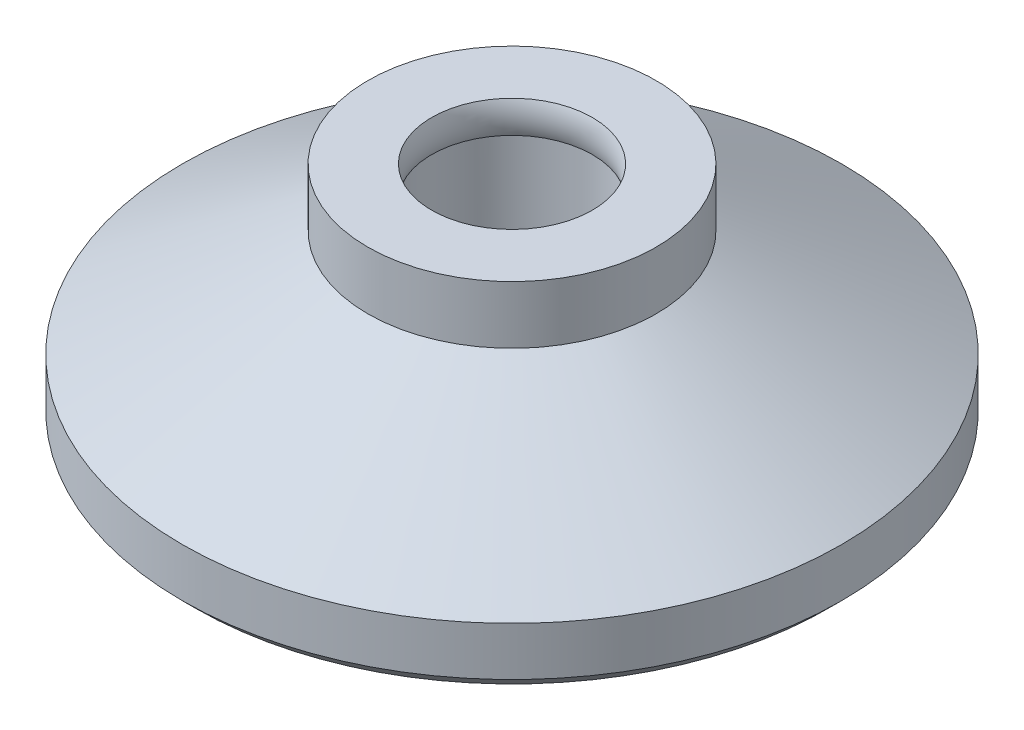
from build123d import *

# Parameters (mm, degrees)
SKETCH1_R      = 7
EXTRUDE1_DEPTH = 5.5
SKETCH3_R      = 16
EXTRUDE2_DEPTH = 3
CHAMFER1_SIZE  = 0.64


with BuildPart() as part:
    # Sketch1 → Extrude1 (new, symmetric)
    with BuildSketch(Plane(origin=(0, 0, 0), x_dir=(1, 0, 0), z_dir=(0, 1, 0))):
        with Locations(Location((0, 0, 0), (0, 0, 270))):
            Circle(SKETCH1_R)
    extrude(amount=EXTRUDE1_DEPTH, both=True)

    # Sketch3 → Extrude2 (add)
    with BuildSketch(Plane.XZ.offset(5.5)):
        with Locations(Location((0, 0, 0), (0, 0, 270))):
            Circle(SKETCH3_R)
    extrude(amount=-EXTRUDE2_DEPTH)

    # Sketch4 → Revolve1 (revolve)
    with BuildSketch(Plane.XY, mode=Mode.PRIVATE) as revolve1_sk:
        Polygon((-16, -2.5), (-7, 2.696152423), (-7, -2.5), align=None)
    revolve(revolve1_sk.sketch.rotate(Axis((0, 5.5, 0), (0, -1, 0)), 270), axis=Axis((0, 5.5, 0), (0, -1, 0)))

    # Chamfer1
    chamfer1_edges = [part.edges().sort_by_distance(p)[0] for p in [
        (0, -5.5, 16),
    ]]
    chamfer(chamfer1_edges, length=CHAMFER1_SIZE)

    # Sketch5 → Cut-Revolve1 (revolve, cut)
    with BuildSketch(Plane.XY, mode=Mode.PRIVATE) as cut_revolve1_sk:
        with BuildLine():
            Line((0, 5.5), (3.9, 5.5))
            ThreePointArc((3.9, 5.5), (3.744, 4.72), (3.9, 3.94))
            Line((3.9, 3.94), (3.9, -0.24833395))
            Line((3.9, -0.24833395), (0, -2.5))
            Line((0, -2.5), (0, 5.5))
        make_face()
    revolve(cut_revolve1_sk.sketch.rotate(Axis((0, 0, 0), (0, 1, 0)), 270), axis=Axis((0, 0, 0), (0, 1, 0)), mode=Mode.SUBTRACT)


solid = part.part
